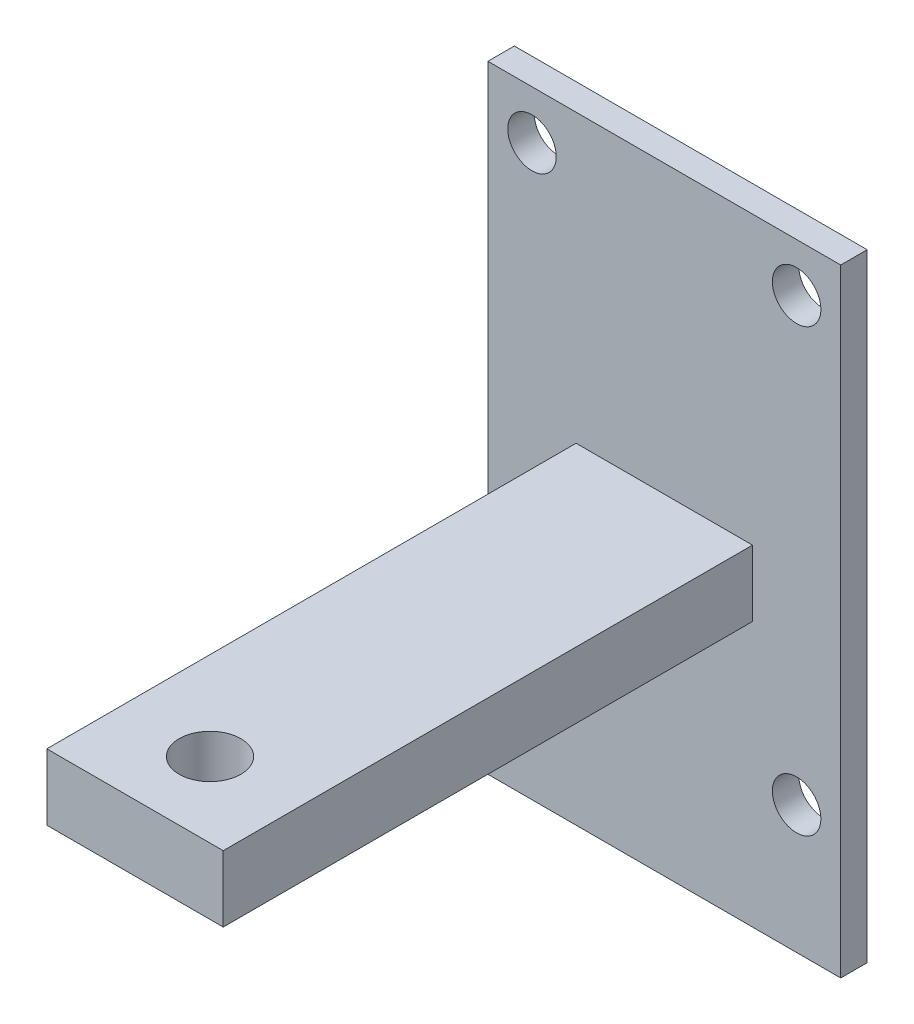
ISO-10303-21;
HEADER;
FILE_DESCRIPTION(('STEP AP214'),'2;1');
FILE_NAME('part.step','',(''),(''),'','','');
FILE_SCHEMA(('AUTOMOTIVE_DESIGN { 1 0 10303 214 1 1 1 1 }'));
ENDSEC;
DATA;
#1=APPLICATION_CONTEXT('core data for automotive mechanical design processes');
#2=APPLICATION_PROTOCOL_DEFINITION('international standard','automotive_design',2000,#1);
#3=PRODUCT_CONTEXT('',#1,'mechanical');
#4=PRODUCT('Part','Part','',(#3));
#5=PRODUCT_RELATED_PRODUCT_CATEGORY('part','',(#4));
#6=PRODUCT_DEFINITION_FORMATION('','',#4);
#7=PRODUCT_DEFINITION_CONTEXT('part definition',#1,'design');
#8=PRODUCT_DEFINITION('design','',#6,#7);
#9=PRODUCT_DEFINITION_SHAPE('','',#8);
#10=(LENGTH_UNIT() NAMED_UNIT(*) SI_UNIT(.MILLI.,.METRE.));
#11=(NAMED_UNIT(*) PLANE_ANGLE_UNIT() SI_UNIT($,.RADIAN.));
#12=(NAMED_UNIT(*) SI_UNIT($,.STERADIAN.) SOLID_ANGLE_UNIT());
#13=UNCERTAINTY_MEASURE_WITH_UNIT(LENGTH_MEASURE(1.E-05),#10,'distance_accuracy_value','');
#14=(GEOMETRIC_REPRESENTATION_CONTEXT(3) GLOBAL_UNCERTAINTY_ASSIGNED_CONTEXT((#13)) GLOBAL_UNIT_ASSIGNED_CONTEXT((#10,
#11,#12)) REPRESENTATION_CONTEXT('',''));
#15=CARTESIAN_POINT('',(0.,0.,0.));
#16=DIRECTION('',(0.,0.,1.));
#17=DIRECTION('',(1.,0.,0.));
#18=AXIS2_PLACEMENT_3D('',#15,#16,#17);
#19=CARTESIAN_POINT('',(0.,140.,6.));
#20=DIRECTION('',(0.,0.,-1.));
#21=DIRECTION('',(-1.,0.,0.));
#22=AXIS2_PLACEMENT_3D('',#19,#20,#21);
#23=PLANE('',#22);
#24=CARTESIAN_POINT('',(10.,29.0000000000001,6.));
#25=DIRECTION('',(0.,0.,1.));
#26=DIRECTION('',(1.,0.,0.));
#27=AXIS2_PLACEMENT_3D('',#24,#25,#26);
#28=CIRCLE('',#27,5.5);
#29=CARTESIAN_POINT('',(15.5,29.0000000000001,6.));
#30=VERTEX_POINT('',#29);
#31=EDGE_CURVE('E271',#30,#30,#28,.T.);
#32=ORIENTED_EDGE('',*,*,#31,.F.);
#33=EDGE_LOOP('',(#32));
#34=FACE_BOUND('',#33,.T.);
#35=CARTESIAN_POINT('',(70.,29.0000000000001,6.));
#36=DIRECTION('',(0.,0.,1.));
#37=DIRECTION('',(1.,0.,0.));
#38=AXIS2_PLACEMENT_3D('',#35,#36,#37);
#39=CIRCLE('',#38,5.5);
#40=CARTESIAN_POINT('',(75.5,29.0000000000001,6.));
#41=VERTEX_POINT('',#40);
#42=EDGE_CURVE('E273',#41,#41,#39,.T.);
#43=ORIENTED_EDGE('',*,*,#42,.F.);
#44=EDGE_LOOP('',(#43));
#45=FACE_BOUND('',#44,.T.);
#46=CARTESIAN_POINT('',(70.,129.,6.));
#47=DIRECTION('',(0.,0.,1.));
#48=DIRECTION('',(1.,0.,0.));
#49=AXIS2_PLACEMENT_3D('',#46,#47,#48);
#50=CIRCLE('',#49,5.5);
#51=CARTESIAN_POINT('',(75.5,129.,6.));
#52=VERTEX_POINT('',#51);
#53=EDGE_CURVE('E279',#52,#52,#50,.T.);
#54=ORIENTED_EDGE('',*,*,#53,.F.);
#55=EDGE_LOOP('',(#54));
#56=FACE_BOUND('',#55,.T.);
#57=CARTESIAN_POINT('',(10.,129.,6.));
#58=DIRECTION('',(0.,0.,1.));
#59=DIRECTION('',(1.,0.,0.));
#60=AXIS2_PLACEMENT_3D('',#57,#58,#59);
#61=CIRCLE('',#60,5.5);
#62=CARTESIAN_POINT('',(15.5,129.,6.));
#63=VERTEX_POINT('',#62);
#64=EDGE_CURVE('E215',#63,#63,#61,.T.);
#65=ORIENTED_EDGE('',*,*,#64,.F.);
#66=EDGE_LOOP('',(#65));
#67=FACE_BOUND('',#66,.T.);
#68=DIRECTION('',(0.,-1.,0.));
#69=VECTOR('',#68,1.);
#70=CARTESIAN_POINT('',(0.,0.,6.));
#71=LINE('',#70,#69);
#72=CARTESIAN_POINT('',(0.,140.,6.));
#73=VERTEX_POINT('',#72);
#74=CARTESIAN_POINT('',(0.,0.,6.));
#75=VERTEX_POINT('',#74);
#76=EDGE_CURVE('E138',#73,#75,#71,.T.);
#77=ORIENTED_EDGE('',*,*,#76,.T.);
#78=DIRECTION('',(1.,0.,0.));
#79=VECTOR('',#78,1.);
#80=CARTESIAN_POINT('',(0.,0.,6.));
#81=LINE('',#80,#79);
#82=CARTESIAN_POINT('',(80.,0.,6.));
#83=VERTEX_POINT('',#82);
#84=EDGE_CURVE('E141',#75,#83,#81,.T.);
#85=ORIENTED_EDGE('',*,*,#84,.T.);
#86=DIRECTION('',(0.,1.,0.));
#87=VECTOR('',#86,1.);
#88=CARTESIAN_POINT('',(80.,0.,6.));
#89=LINE('',#88,#87);
#90=CARTESIAN_POINT('',(80.,140.,6.));
#91=VERTEX_POINT('',#90);
#92=EDGE_CURVE('E143',#83,#91,#89,.T.);
#93=ORIENTED_EDGE('',*,*,#92,.T.);
#94=DIRECTION('',(-1.,0.,0.));
#95=VECTOR('',#94,1.);
#96=CARTESIAN_POINT('',(0.,140.,6.));
#97=LINE('',#96,#95);
#98=EDGE_CURVE('E145',#91,#73,#97,.T.);
#99=ORIENTED_EDGE('',*,*,#98,.T.);
#100=EDGE_LOOP('',(#77,#85,#93,#99));
#101=FACE_BOUND('',#100,.T.);
#102=DIRECTION('',(0.,-1.,0.));
#103=VECTOR('',#102,1.);
#104=CARTESIAN_POINT('',(20.,75.,6.));
#105=LINE('',#104,#103);
#106=CARTESIAN_POINT('',(20.,75.,6.));
#107=VERTEX_POINT('',#106);
#108=CARTESIAN_POINT('',(20.,60.,6.));
#109=VERTEX_POINT('',#108);
#110=EDGE_CURVE('E96',#107,#109,#105,.T.);
#111=ORIENTED_EDGE('',*,*,#110,.F.);
#112=DIRECTION('',(-1.,0.,0.));
#113=VECTOR('',#112,1.);
#114=CARTESIAN_POINT('',(20.,75.,6.));
#115=LINE('',#114,#113);
#116=CARTESIAN_POINT('',(60.,75.,6.));
#117=VERTEX_POINT('',#116);
#118=EDGE_CURVE('E98',#117,#107,#115,.T.);
#119=ORIENTED_EDGE('',*,*,#118,.F.);
#120=DIRECTION('',(0.,1.,0.));
#121=VECTOR('',#120,1.);
#122=CARTESIAN_POINT('',(60.,75.,6.));
#123=LINE('',#122,#121);
#124=CARTESIAN_POINT('',(60.,60.,6.));
#125=VERTEX_POINT('',#124);
#126=EDGE_CURVE('E55',#125,#117,#123,.T.);
#127=ORIENTED_EDGE('',*,*,#126,.F.);
#128=DIRECTION('',(1.,0.,0.));
#129=VECTOR('',#128,1.);
#130=CARTESIAN_POINT('',(20.,60.,6.));
#131=LINE('',#130,#129);
#132=EDGE_CURVE('E50',#109,#125,#131,.T.);
#133=ORIENTED_EDGE('',*,*,#132,.F.);
#134=EDGE_LOOP('',(#111,#119,#127,#133));
#135=FACE_BOUND('',#134,.T.);
#136=ADVANCED_FACE('F35',(#34,#45,#56,#67,#101,#135),#23,.F.);
#137=CARTESIAN_POINT('',(0.,0.,6.));
#138=DIRECTION('',(1.,0.,0.));
#139=DIRECTION('',(0.,0.,-1.));
#140=AXIS2_PLACEMENT_3D('',#137,#138,#139);
#141=PLANE('',#140);
#142=DIRECTION('',(0.,-1.,0.));
#143=VECTOR('',#142,1.);
#144=CARTESIAN_POINT('',(0.,0.,0.));
#145=LINE('',#144,#143);
#146=CARTESIAN_POINT('',(0.,140.,0.));
#147=VERTEX_POINT('',#146);
#148=CARTESIAN_POINT('',(0.,0.,0.));
#149=VERTEX_POINT('',#148);
#150=EDGE_CURVE('E129',#147,#149,#145,.T.);
#151=ORIENTED_EDGE('',*,*,#150,.T.);
#152=DIRECTION('',(0.,0.,-1.));
#153=VECTOR('',#152,1.);
#154=CARTESIAN_POINT('',(0.,0.,6.));
#155=LINE('',#154,#153);
#156=EDGE_CURVE('E11',#75,#149,#155,.T.);
#157=ORIENTED_EDGE('',*,*,#156,.F.);
#158=ORIENTED_EDGE('',*,*,#76,.F.);
#159=DIRECTION('',(0.,0.,-1.));
#160=VECTOR('',#159,1.);
#161=CARTESIAN_POINT('',(0.,140.,6.));
#162=LINE('',#161,#160);
#163=EDGE_CURVE('E147',#73,#147,#162,.T.);
#164=ORIENTED_EDGE('',*,*,#163,.T.);
#165=EDGE_LOOP('',(#151,#157,#158,#164));
#166=FACE_BOUND('',#165,.T.);
#167=ADVANCED_FACE('F37',(#166),#141,.F.);
#168=CARTESIAN_POINT('',(0.,0.,6.));
#169=DIRECTION('',(0.,1.,0.));
#170=DIRECTION('',(0.,0.,1.));
#171=AXIS2_PLACEMENT_3D('',#168,#169,#170);
#172=PLANE('',#171);
#173=DIRECTION('',(1.,0.,0.));
#174=VECTOR('',#173,1.);
#175=CARTESIAN_POINT('',(0.,0.,0.));
#176=LINE('',#175,#174);
#177=CARTESIAN_POINT('',(80.,0.,0.));
#178=VERTEX_POINT('',#177);
#179=EDGE_CURVE('E132',#149,#178,#176,.T.);
#180=ORIENTED_EDGE('',*,*,#179,.T.);
#181=DIRECTION('',(0.,0.,-1.));
#182=VECTOR('',#181,1.);
#183=CARTESIAN_POINT('',(80.,0.,6.));
#184=LINE('',#183,#182);
#185=EDGE_CURVE('E43',#83,#178,#184,.T.);
#186=ORIENTED_EDGE('',*,*,#185,.F.);
#187=ORIENTED_EDGE('',*,*,#84,.F.);
#188=ORIENTED_EDGE('',*,*,#156,.T.);
#189=EDGE_LOOP('',(#180,#186,#187,#188));
#190=FACE_BOUND('',#189,.T.);
#191=ADVANCED_FACE('F172',(#190),#172,.F.);
#192=CARTESIAN_POINT('',(80.,0.,6.));
#193=DIRECTION('',(-1.,0.,0.));
#194=DIRECTION('',(0.,0.,1.));
#195=AXIS2_PLACEMENT_3D('',#192,#193,#194);
#196=PLANE('',#195);
#197=DIRECTION('',(0.,1.,0.));
#198=VECTOR('',#197,1.);
#199=CARTESIAN_POINT('',(80.,0.,0.));
#200=LINE('',#199,#198);
#201=CARTESIAN_POINT('',(80.,140.,0.));
#202=VERTEX_POINT('',#201);
#203=EDGE_CURVE('E134',#178,#202,#200,.T.);
#204=ORIENTED_EDGE('',*,*,#203,.T.);
#205=DIRECTION('',(0.,0.,-1.));
#206=VECTOR('',#205,1.);
#207=CARTESIAN_POINT('',(80.,140.,6.));
#208=LINE('',#207,#206);
#209=EDGE_CURVE('E150',#91,#202,#208,.T.);
#210=ORIENTED_EDGE('',*,*,#209,.F.);
#211=ORIENTED_EDGE('',*,*,#92,.F.);
#212=ORIENTED_EDGE('',*,*,#185,.T.);
#213=EDGE_LOOP('',(#204,#210,#211,#212));
#214=FACE_BOUND('',#213,.T.);
#215=ADVANCED_FACE('F157',(#214),#196,.F.);
#216=CARTESIAN_POINT('',(0.,140.,6.));
#217=DIRECTION('',(0.,-1.,0.));
#218=DIRECTION('',(0.,0.,-1.));
#219=AXIS2_PLACEMENT_3D('',#216,#217,#218);
#220=PLANE('',#219);
#221=DIRECTION('',(-1.,0.,0.));
#222=VECTOR('',#221,1.);
#223=CARTESIAN_POINT('',(0.,140.,0.));
#224=LINE('',#223,#222);
#225=EDGE_CURVE('E136',#202,#147,#224,.T.);
#226=ORIENTED_EDGE('',*,*,#225,.T.);
#227=ORIENTED_EDGE('',*,*,#163,.F.);
#228=ORIENTED_EDGE('',*,*,#98,.F.);
#229=ORIENTED_EDGE('',*,*,#209,.T.);
#230=EDGE_LOOP('',(#226,#227,#228,#229));
#231=FACE_BOUND('',#230,.T.);
#232=ADVANCED_FACE('F166',(#231),#220,.F.);
#233=CARTESIAN_POINT('',(0.,140.,0.));
#234=DIRECTION('',(0.,0.,-1.));
#235=DIRECTION('',(-1.,0.,0.));
#236=AXIS2_PLACEMENT_3D('',#233,#234,#235);
#237=PLANE('',#236);
#238=CARTESIAN_POINT('',(10.,29.0000000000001,0.));
#239=DIRECTION('',(0.,0.,1.));
#240=DIRECTION('',(1.,0.,0.));
#241=AXIS2_PLACEMENT_3D('',#238,#239,#240);
#242=CIRCLE('',#241,5.5);
#243=CARTESIAN_POINT('',(15.5,29.0000000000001,0.));
#244=VERTEX_POINT('',#243);
#245=EDGE_CURVE('E201',#244,#244,#242,.T.);
#246=ORIENTED_EDGE('',*,*,#245,.T.);
#247=EDGE_LOOP('',(#246));
#248=FACE_BOUND('',#247,.T.);
#249=CARTESIAN_POINT('',(70.,29.0000000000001,0.));
#250=DIRECTION('',(0.,0.,1.));
#251=DIRECTION('',(1.,0.,0.));
#252=AXIS2_PLACEMENT_3D('',#249,#250,#251);
#253=CIRCLE('',#252,5.5);
#254=CARTESIAN_POINT('',(75.5,29.0000000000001,0.));
#255=VERTEX_POINT('',#254);
#256=EDGE_CURVE('E205',#255,#255,#253,.T.);
#257=ORIENTED_EDGE('',*,*,#256,.T.);
#258=EDGE_LOOP('',(#257));
#259=FACE_BOUND('',#258,.T.);
#260=CARTESIAN_POINT('',(70.,129.,0.));
#261=DIRECTION('',(0.,0.,1.));
#262=DIRECTION('',(1.,0.,0.));
#263=AXIS2_PLACEMENT_3D('',#260,#261,#262);
#264=CIRCLE('',#263,5.5);
#265=CARTESIAN_POINT('',(75.5,129.,0.));
#266=VERTEX_POINT('',#265);
#267=EDGE_CURVE('E209',#266,#266,#264,.T.);
#268=ORIENTED_EDGE('',*,*,#267,.T.);
#269=EDGE_LOOP('',(#268));
#270=FACE_BOUND('',#269,.T.);
#271=CARTESIAN_POINT('',(10.,129.,0.));
#272=DIRECTION('',(0.,0.,1.));
#273=DIRECTION('',(1.,0.,0.));
#274=AXIS2_PLACEMENT_3D('',#271,#272,#273);
#275=CIRCLE('',#274,5.5);
#276=CARTESIAN_POINT('',(15.5,129.,0.));
#277=VERTEX_POINT('',#276);
#278=EDGE_CURVE('E212',#277,#277,#275,.T.);
#279=ORIENTED_EDGE('',*,*,#278,.T.);
#280=EDGE_LOOP('',(#279));
#281=FACE_BOUND('',#280,.T.);
#282=ORIENTED_EDGE('',*,*,#150,.F.);
#283=ORIENTED_EDGE('',*,*,#225,.F.);
#284=ORIENTED_EDGE('',*,*,#203,.F.);
#285=ORIENTED_EDGE('',*,*,#179,.F.);
#286=EDGE_LOOP('',(#282,#283,#284,#285));
#287=FACE_BOUND('',#286,.T.);
#288=ADVANCED_FACE('F163',(#248,#259,#270,#281,#287),#237,.T.);
#289=CARTESIAN_POINT('',(20.,75.,126.));
#290=DIRECTION('',(1.,0.,0.));
#291=DIRECTION('',(0.,0.,-1.));
#292=AXIS2_PLACEMENT_3D('',#289,#290,#291);
#293=PLANE('',#292);
#294=ORIENTED_EDGE('',*,*,#110,.T.);
#295=DIRECTION('',(0.,0.,-1.));
#296=VECTOR('',#295,1.);
#297=CARTESIAN_POINT('',(20.,60.,126.));
#298=LINE('',#297,#296);
#299=CARTESIAN_POINT('',(20.,60.,126.));
#300=VERTEX_POINT('',#299);
#301=EDGE_CURVE('E127',#300,#109,#298,.T.);
#302=ORIENTED_EDGE('',*,*,#301,.F.);
#303=DIRECTION('',(0.,-1.,0.));
#304=VECTOR('',#303,1.);
#305=CARTESIAN_POINT('',(20.,75.,126.));
#306=LINE('',#305,#304);
#307=CARTESIAN_POINT('',(20.,75.,126.));
#308=VERTEX_POINT('',#307);
#309=EDGE_CURVE('E113',#308,#300,#306,.T.);
#310=ORIENTED_EDGE('',*,*,#309,.F.);
#311=DIRECTION('',(0.,0.,-1.));
#312=VECTOR('',#311,1.);
#313=CARTESIAN_POINT('',(20.,75.,126.));
#314=LINE('',#313,#312);
#315=EDGE_CURVE('E109',#308,#107,#314,.T.);
#316=ORIENTED_EDGE('',*,*,#315,.T.);
#317=EDGE_LOOP('',(#294,#302,#310,#316));
#318=FACE_BOUND('',#317,.T.);
#319=ADVANCED_FACE('F115',(#318),#293,.F.);
#320=CARTESIAN_POINT('',(20.,60.,126.));
#321=DIRECTION('',(0.,1.,0.));
#322=DIRECTION('',(0.,0.,1.));
#323=AXIS2_PLACEMENT_3D('',#320,#321,#322);
#324=PLANE('',#323);
#325=CARTESIAN_POINT('',(40.,60.,109.));
#326=DIRECTION('',(0.,1.,0.));
#327=DIRECTION('',(0.,0.,1.));
#328=AXIS2_PLACEMENT_3D('',#325,#326,#327);
#329=CIRCLE('',#328,7.);
#330=CARTESIAN_POINT('',(40.,60.,116.));
#331=VERTEX_POINT('',#330);
#332=EDGE_CURVE('E102',#331,#331,#329,.T.);
#333=ORIENTED_EDGE('',*,*,#332,.T.);
#334=EDGE_LOOP('',(#333));
#335=FACE_BOUND('',#334,.T.);
#336=ORIENTED_EDGE('',*,*,#132,.T.);
#337=DIRECTION('',(0.,0.,-1.));
#338=VECTOR('',#337,1.);
#339=CARTESIAN_POINT('',(60.,60.,126.));
#340=LINE('',#339,#338);
#341=CARTESIAN_POINT('',(60.,60.,126.));
#342=VERTEX_POINT('',#341);
#343=EDGE_CURVE('E119',#342,#125,#340,.T.);
#344=ORIENTED_EDGE('',*,*,#343,.F.);
#345=DIRECTION('',(1.,0.,0.));
#346=VECTOR('',#345,1.);
#347=CARTESIAN_POINT('',(20.,60.,126.));
#348=LINE('',#347,#346);
#349=EDGE_CURVE('E228',#300,#342,#348,.T.);
#350=ORIENTED_EDGE('',*,*,#349,.F.);
#351=ORIENTED_EDGE('',*,*,#301,.T.);
#352=EDGE_LOOP('',(#336,#344,#350,#351));
#353=FACE_BOUND('',#352,.T.);
#354=ADVANCED_FACE('F197',(#335,#353),#324,.F.);
#355=CARTESIAN_POINT('',(60.,75.,126.));
#356=DIRECTION('',(-1.,0.,0.));
#357=DIRECTION('',(0.,0.,1.));
#358=AXIS2_PLACEMENT_3D('',#355,#356,#357);
#359=PLANE('',#358);
#360=ORIENTED_EDGE('',*,*,#126,.T.);
#361=DIRECTION('',(0.,0.,-1.));
#362=VECTOR('',#361,1.);
#363=CARTESIAN_POINT('',(60.,75.,126.));
#364=LINE('',#363,#362);
#365=CARTESIAN_POINT('',(60.,75.,126.));
#366=VERTEX_POINT('',#365);
#367=EDGE_CURVE('E112',#366,#117,#364,.T.);
#368=ORIENTED_EDGE('',*,*,#367,.F.);
#369=DIRECTION('',(0.,1.,0.));
#370=VECTOR('',#369,1.);
#371=CARTESIAN_POINT('',(60.,75.,126.));
#372=LINE('',#371,#370);
#373=EDGE_CURVE('E121',#342,#366,#372,.T.);
#374=ORIENTED_EDGE('',*,*,#373,.F.);
#375=ORIENTED_EDGE('',*,*,#343,.T.);
#376=EDGE_LOOP('',(#360,#368,#374,#375));
#377=FACE_BOUND('',#376,.T.);
#378=ADVANCED_FACE('F234',(#377),#359,.F.);
#379=CARTESIAN_POINT('',(20.,75.,126.));
#380=DIRECTION('',(0.,-1.,0.));
#381=DIRECTION('',(0.,0.,-1.));
#382=AXIS2_PLACEMENT_3D('',#379,#380,#381);
#383=PLANE('',#382);
#384=CARTESIAN_POINT('',(40.,75.,109.));
#385=DIRECTION('',(0.,1.,0.));
#386=DIRECTION('',(0.,0.,1.));
#387=AXIS2_PLACEMENT_3D('',#384,#385,#386);
#388=CIRCLE('',#387,7.);
#389=CARTESIAN_POINT('',(40.,75.,116.));
#390=VERTEX_POINT('',#389);
#391=EDGE_CURVE('E214',#390,#390,#388,.T.);
#392=ORIENTED_EDGE('',*,*,#391,.F.);
#393=EDGE_LOOP('',(#392));
#394=FACE_BOUND('',#393,.T.);
#395=ORIENTED_EDGE('',*,*,#118,.T.);
#396=ORIENTED_EDGE('',*,*,#315,.F.);
#397=DIRECTION('',(-1.,0.,0.));
#398=VECTOR('',#397,1.);
#399=CARTESIAN_POINT('',(20.,75.,126.));
#400=LINE('',#399,#398);
#401=EDGE_CURVE('E117',#366,#308,#400,.T.);
#402=ORIENTED_EDGE('',*,*,#401,.F.);
#403=ORIENTED_EDGE('',*,*,#367,.T.);
#404=EDGE_LOOP('',(#395,#396,#402,#403));
#405=FACE_BOUND('',#404,.T.);
#406=ADVANCED_FACE('F107',(#394,#405),#383,.F.);
#407=CARTESIAN_POINT('',(20.,60.,126.));
#408=DIRECTION('',(0.,0.,1.));
#409=DIRECTION('',(1.,0.,0.));
#410=AXIS2_PLACEMENT_3D('',#407,#408,#409);
#411=PLANE('',#410);
#412=ORIENTED_EDGE('',*,*,#309,.T.);
#413=ORIENTED_EDGE('',*,*,#349,.T.);
#414=ORIENTED_EDGE('',*,*,#373,.T.);
#415=ORIENTED_EDGE('',*,*,#401,.T.);
#416=EDGE_LOOP('',(#412,#413,#414,#415));
#417=FACE_BOUND('',#416,.T.);
#418=ADVANCED_FACE('F231',(#417),#411,.T.);
#419=CARTESIAN_POINT('',(40.,0.,109.));
#420=DIRECTION('',(0.,1.,0.));
#421=DIRECTION('',(0.,0.,1.));
#422=AXIS2_PLACEMENT_3D('',#419,#420,#421);
#423=CYLINDRICAL_SURFACE('',#422,7.);
#424=ORIENTED_EDGE('',*,*,#391,.T.);
#425=EDGE_LOOP('',(#424));
#426=FACE_BOUND('',#425,.T.);
#427=ORIENTED_EDGE('',*,*,#332,.F.);
#428=EDGE_LOOP('',(#427));
#429=FACE_BOUND('',#428,.T.);
#430=ADVANCED_FACE('F249',(#426,#429),#423,.F.);
#431=CARTESIAN_POINT('',(10.,129.,0.));
#432=DIRECTION('',(0.,0.,1.));
#433=DIRECTION('',(1.,0.,0.));
#434=AXIS2_PLACEMENT_3D('',#431,#432,#433);
#435=CYLINDRICAL_SURFACE('',#434,5.5);
#436=ORIENTED_EDGE('',*,*,#278,.F.);
#437=EDGE_LOOP('',(#436));
#438=FACE_BOUND('',#437,.T.);
#439=ORIENTED_EDGE('',*,*,#64,.T.);
#440=EDGE_LOOP('',(#439));
#441=FACE_BOUND('',#440,.T.);
#442=ADVANCED_FACE('F252',(#438,#441),#435,.F.);
#443=CARTESIAN_POINT('',(70.,129.,0.));
#444=DIRECTION('',(0.,0.,1.));
#445=DIRECTION('',(1.,0.,0.));
#446=AXIS2_PLACEMENT_3D('',#443,#444,#445);
#447=CYLINDRICAL_SURFACE('',#446,5.5);
#448=ORIENTED_EDGE('',*,*,#267,.F.);
#449=EDGE_LOOP('',(#448));
#450=FACE_BOUND('',#449,.T.);
#451=ORIENTED_EDGE('',*,*,#53,.T.);
#452=EDGE_LOOP('',(#451));
#453=FACE_BOUND('',#452,.T.);
#454=ADVANCED_FACE('F256',(#450,#453),#447,.F.);
#455=CARTESIAN_POINT('',(70.,29.0000000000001,0.));
#456=DIRECTION('',(0.,0.,1.));
#457=DIRECTION('',(1.,0.,0.));
#458=AXIS2_PLACEMENT_3D('',#455,#456,#457);
#459=CYLINDRICAL_SURFACE('',#458,5.5);
#460=ORIENTED_EDGE('',*,*,#256,.F.);
#461=EDGE_LOOP('',(#460));
#462=FACE_BOUND('',#461,.T.);
#463=ORIENTED_EDGE('',*,*,#42,.T.);
#464=EDGE_LOOP('',(#463));
#465=FACE_BOUND('',#464,.T.);
#466=ADVANCED_FACE('F259',(#462,#465),#459,.F.);
#467=CARTESIAN_POINT('',(10.,29.0000000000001,0.));
#468=DIRECTION('',(0.,0.,1.));
#469=DIRECTION('',(1.,0.,0.));
#470=AXIS2_PLACEMENT_3D('',#467,#468,#469);
#471=CYLINDRICAL_SURFACE('',#470,5.5);
#472=ORIENTED_EDGE('',*,*,#245,.F.);
#473=EDGE_LOOP('',(#472));
#474=FACE_BOUND('',#473,.T.);
#475=ORIENTED_EDGE('',*,*,#31,.T.);
#476=EDGE_LOOP('',(#475));
#477=FACE_BOUND('',#476,.T.);
#478=ADVANCED_FACE('F263',(#474,#477),#471,.F.);
#479=CLOSED_SHELL('',(#136,#167,#191,#215,#232,#288,#319,#354,#378,#406,#418,#430,#442,#454,
#466,#478));
#480=MANIFOLD_SOLID_BREP('B2',#479);
#481=ADVANCED_BREP_SHAPE_REPRESENTATION('',(#18,#480),#14);
#482=SHAPE_DEFINITION_REPRESENTATION(#9,#481);
ENDSEC;
END-ISO-10303-21;
